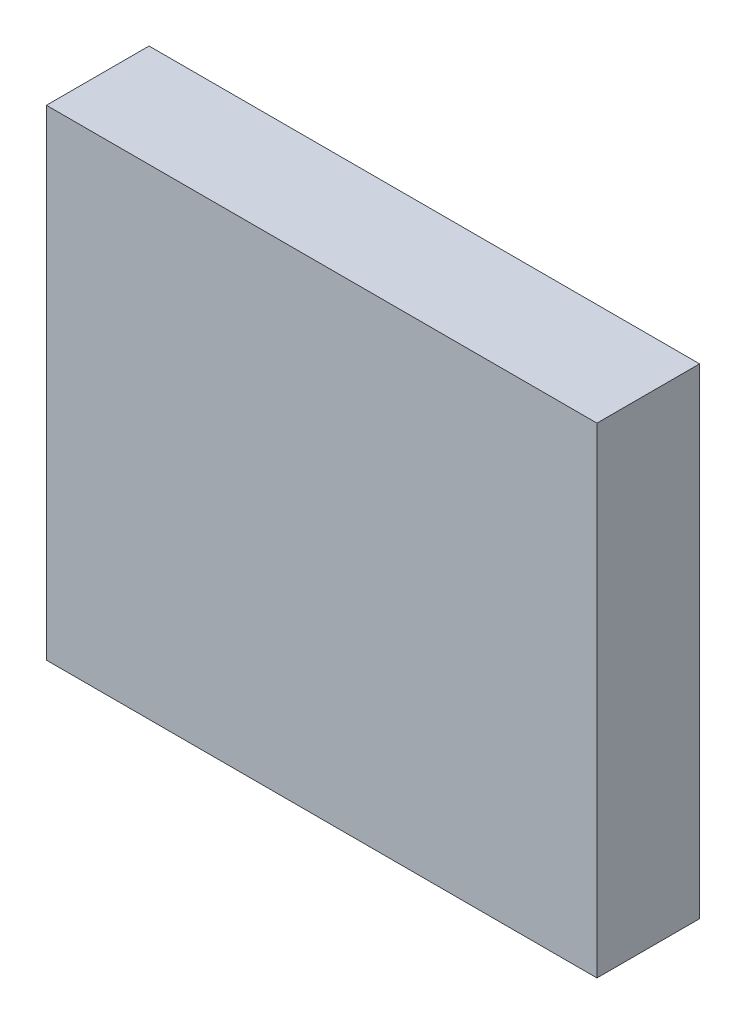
ISO-10303-21;
HEADER;
FILE_DESCRIPTION(('STEP AP214'),'2;1');
FILE_NAME('part.step','',(''),(''),'','','');
FILE_SCHEMA(('AUTOMOTIVE_DESIGN { 1 0 10303 214 1 1 1 1 }'));
ENDSEC;
DATA;
#1=APPLICATION_CONTEXT('core data for automotive mechanical design processes');
#2=APPLICATION_PROTOCOL_DEFINITION('international standard','automotive_design',2000,#1);
#3=PRODUCT_CONTEXT('',#1,'mechanical');
#4=PRODUCT('Part','Part','',(#3));
#5=PRODUCT_RELATED_PRODUCT_CATEGORY('part','',(#4));
#6=PRODUCT_DEFINITION_FORMATION('','',#4);
#7=PRODUCT_DEFINITION_CONTEXT('part definition',#1,'design');
#8=PRODUCT_DEFINITION('design','',#6,#7);
#9=PRODUCT_DEFINITION_SHAPE('','',#8);
#10=(LENGTH_UNIT() NAMED_UNIT(*) SI_UNIT(.MILLI.,.METRE.));
#11=(NAMED_UNIT(*) PLANE_ANGLE_UNIT() SI_UNIT($,.RADIAN.));
#12=(NAMED_UNIT(*) SI_UNIT($,.STERADIAN.) SOLID_ANGLE_UNIT());
#13=UNCERTAINTY_MEASURE_WITH_UNIT(LENGTH_MEASURE(1.E-05),#10,'distance_accuracy_value','');
#14=(GEOMETRIC_REPRESENTATION_CONTEXT(3) GLOBAL_UNCERTAINTY_ASSIGNED_CONTEXT((#13)) GLOBAL_UNIT_ASSIGNED_CONTEXT((#10,
#11,#12)) REPRESENTATION_CONTEXT('',''));
#15=CARTESIAN_POINT('',(0.,0.,0.));
#16=DIRECTION('',(0.,0.,1.));
#17=DIRECTION('',(1.,0.,0.));
#18=AXIS2_PLACEMENT_3D('',#15,#16,#17);
#19=CARTESIAN_POINT('',(-2.94999914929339,-2.57500377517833,0.));
#20=DIRECTION('',(-1.,-1.19248806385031E-08,0.));
#21=DIRECTION('',(-1.19248806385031E-08,1.,0.));
#22=AXIS2_PLACEMENT_3D('',#19,#20,#21);
#23=PLANE('',#22);
#24=DIRECTION('',(0.,0.,1.));
#25=VECTOR('',#24,1.);
#26=CARTESIAN_POINT('',(-2.94999914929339,-2.57500377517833,0.));
#27=LINE('',#26,#25);
#28=CARTESIAN_POINT('',(-2.94999914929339,-2.57500377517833,0.));
#29=VERTEX_POINT('',#28);
#30=CARTESIAN_POINT('',(-2.94999914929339,-2.57500377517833,1.10000034));
#31=VERTEX_POINT('',#30);
#32=EDGE_CURVE('E11',#29,#31,#27,.T.);
#33=ORIENTED_EDGE('',*,*,#32,.T.);
#34=DIRECTION('',(-1.19248806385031E-08,1.,0.));
#35=VECTOR('',#34,1.);
#36=CARTESIAN_POINT('',(-2.94999914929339,-2.57500377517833,1.10000034));
#37=LINE('',#36,#35);
#38=CARTESIAN_POINT('',(-2.94999921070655,2.57499862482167,1.10000034));
#39=VERTEX_POINT('',#38);
#40=EDGE_CURVE('E24',#31,#39,#37,.T.);
#41=ORIENTED_EDGE('',*,*,#40,.T.);
#42=DIRECTION('',(0.,0.,1.));
#43=VECTOR('',#42,1.);
#44=CARTESIAN_POINT('',(-2.94999921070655,2.57499862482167,0.));
#45=LINE('',#44,#43);
#46=CARTESIAN_POINT('',(-2.94999921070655,2.57499862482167,0.));
#47=VERTEX_POINT('',#46);
#48=EDGE_CURVE('E84',#47,#39,#45,.T.);
#49=ORIENTED_EDGE('',*,*,#48,.F.);
#50=DIRECTION('',(-1.19248806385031E-08,1.,0.));
#51=VECTOR('',#50,1.);
#52=CARTESIAN_POINT('',(-2.94999914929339,-2.57500377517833,0.));
#53=LINE('',#52,#51);
#54=EDGE_CURVE('E82',#29,#47,#53,.T.);
#55=ORIENTED_EDGE('',*,*,#54,.F.);
#56=EDGE_LOOP('',(#33,#41,#49,#55));
#57=FACE_BOUND('',#56,.T.);
#58=ADVANCED_FACE('F17',(#57),#23,.T.);
#59=CARTESIAN_POINT('',(-2.94999921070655,2.57499862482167,0.));
#60=DIRECTION('',(4.18583893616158E-07,0.999999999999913,0.));
#61=DIRECTION('',(0.999999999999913,-4.18583893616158E-07,0.));
#62=AXIS2_PLACEMENT_3D('',#59,#60,#61);
#63=PLANE('',#62);
#64=ORIENTED_EDGE('',*,*,#48,.T.);
#65=DIRECTION('',(0.999999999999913,-4.18583893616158E-07,0.));
#66=VECTOR('',#65,1.);
#67=CARTESIAN_POINT('',(-2.94999921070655,2.57499862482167,1.10000034));
#68=LINE('',#67,#66);
#69=CARTESIAN_POINT('',(2.94999660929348,2.57499615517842,1.10000034));
#70=VERTEX_POINT('',#69);
#71=EDGE_CURVE('E79',#39,#70,#68,.T.);
#72=ORIENTED_EDGE('',*,*,#71,.T.);
#73=DIRECTION('',(0.,0.,1.));
#74=VECTOR('',#73,1.);
#75=CARTESIAN_POINT('',(2.94999660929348,2.57499615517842,0.));
#76=LINE('',#75,#74);
#77=CARTESIAN_POINT('',(2.94999660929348,2.57499615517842,0.));
#78=VERTEX_POINT('',#77);
#79=EDGE_CURVE('E77',#78,#70,#76,.T.);
#80=ORIENTED_EDGE('',*,*,#79,.F.);
#81=DIRECTION('',(0.999999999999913,-4.18583893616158E-07,0.));
#82=VECTOR('',#81,1.);
#83=CARTESIAN_POINT('',(-2.94999921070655,2.57499862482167,0.));
#84=LINE('',#83,#82);
#85=EDGE_CURVE('E58',#47,#78,#84,.T.);
#86=ORIENTED_EDGE('',*,*,#85,.F.);
#87=EDGE_LOOP('',(#64,#72,#80,#86));
#88=FACE_BOUND('',#87,.T.);
#89=ADVANCED_FACE('F90',(#88),#63,.T.);
#90=CARTESIAN_POINT('',(2.94999660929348,2.57499615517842,0.));
#91=DIRECTION('',(1.,1.19248806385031E-08,0.));
#92=DIRECTION('',(1.19248806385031E-08,-1.,0.));
#93=AXIS2_PLACEMENT_3D('',#90,#91,#92);
#94=PLANE('',#93);
#95=ORIENTED_EDGE('',*,*,#79,.T.);
#96=DIRECTION('',(1.19248806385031E-08,-1.,0.));
#97=VECTOR('',#96,1.);
#98=CARTESIAN_POINT('',(2.94999660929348,2.57499615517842,1.10000034));
#99=LINE('',#98,#97);
#100=CARTESIAN_POINT('',(2.94999667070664,-2.57500624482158,1.10000034));
#101=VERTEX_POINT('',#100);
#102=EDGE_CURVE('E70',#70,#101,#99,.T.);
#103=ORIENTED_EDGE('',*,*,#102,.T.);
#104=DIRECTION('',(0.,0.,1.));
#105=VECTOR('',#104,1.);
#106=CARTESIAN_POINT('',(2.94999667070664,-2.57500624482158,0.));
#107=LINE('',#106,#105);
#108=CARTESIAN_POINT('',(2.94999667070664,-2.57500624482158,0.));
#109=VERTEX_POINT('',#108);
#110=EDGE_CURVE('E63',#109,#101,#107,.T.);
#111=ORIENTED_EDGE('',*,*,#110,.F.);
#112=DIRECTION('',(1.19248806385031E-08,-1.,0.));
#113=VECTOR('',#112,1.);
#114=CARTESIAN_POINT('',(2.94999660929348,2.57499615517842,0.));
#115=LINE('',#114,#113);
#116=EDGE_CURVE('E54',#78,#109,#115,.T.);
#117=ORIENTED_EDGE('',*,*,#116,.F.);
#118=EDGE_LOOP('',(#95,#103,#111,#117));
#119=FACE_BOUND('',#118,.T.);
#120=ADVANCED_FACE('F69',(#119),#94,.T.);
#121=CARTESIAN_POINT('',(2.94999667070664,-2.57500624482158,0.));
#122=DIRECTION('',(-4.18583893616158E-07,-0.999999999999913,0.));
#123=DIRECTION('',(-0.999999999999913,4.18583893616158E-07,0.));
#124=AXIS2_PLACEMENT_3D('',#121,#122,#123);
#125=PLANE('',#124);
#126=ORIENTED_EDGE('',*,*,#110,.T.);
#127=DIRECTION('',(-0.999999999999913,4.18583893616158E-07,0.));
#128=VECTOR('',#127,1.);
#129=CARTESIAN_POINT('',(2.94999667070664,-2.57500624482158,1.10000034));
#130=LINE('',#129,#128);
#131=EDGE_CURVE('E64',#101,#31,#130,.T.);
#132=ORIENTED_EDGE('',*,*,#131,.T.);
#133=ORIENTED_EDGE('',*,*,#32,.F.);
#134=DIRECTION('',(-0.999999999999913,4.18583893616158E-07,0.));
#135=VECTOR('',#134,1.);
#136=CARTESIAN_POINT('',(2.94999667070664,-2.57500624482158,0.));
#137=LINE('',#136,#135);
#138=EDGE_CURVE('E57',#109,#29,#137,.T.);
#139=ORIENTED_EDGE('',*,*,#138,.F.);
#140=EDGE_LOOP('',(#126,#132,#133,#139));
#141=FACE_BOUND('',#140,.T.);
#142=ADVANCED_FACE('F67',(#141),#125,.T.);
#143=CARTESIAN_POINT('',(-2.94999914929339,-2.57500377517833,0.));
#144=DIRECTION('',(0.,0.,1.));
#145=DIRECTION('',(1.19248806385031E-08,-1.,0.));
#146=AXIS2_PLACEMENT_3D('',#143,#144,#145);
#147=PLANE('',#146);
#148=ORIENTED_EDGE('',*,*,#54,.T.);
#149=ORIENTED_EDGE('',*,*,#85,.T.);
#150=ORIENTED_EDGE('',*,*,#116,.T.);
#151=ORIENTED_EDGE('',*,*,#138,.T.);
#152=EDGE_LOOP('',(#148,#149,#150,#151));
#153=FACE_BOUND('',#152,.T.);
#154=ADVANCED_FACE('F56',(#153),#147,.F.);
#155=CARTESIAN_POINT('',(-2.94999914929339,-2.57500377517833,1.10000034));
#156=DIRECTION('',(0.,0.,1.));
#157=DIRECTION('',(1.19248806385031E-08,-1.,0.));
#158=AXIS2_PLACEMENT_3D('',#155,#156,#157);
#159=PLANE('',#158);
#160=ORIENTED_EDGE('',*,*,#131,.F.);
#161=ORIENTED_EDGE('',*,*,#102,.F.);
#162=ORIENTED_EDGE('',*,*,#71,.F.);
#163=ORIENTED_EDGE('',*,*,#40,.F.);
#164=EDGE_LOOP('',(#160,#161,#162,#163));
#165=FACE_BOUND('',#164,.T.);
#166=ADVANCED_FACE('F91',(#165),#159,.T.);
#167=CLOSED_SHELL('',(#58,#89,#120,#142,#154,#166));
#168=MANIFOLD_SOLID_BREP('B1',#167);
#169=ADVANCED_BREP_SHAPE_REPRESENTATION('',(#18,#168),#14);
#170=SHAPE_DEFINITION_REPRESENTATION(#9,#169);
ENDSEC;
END-ISO-10303-21;
